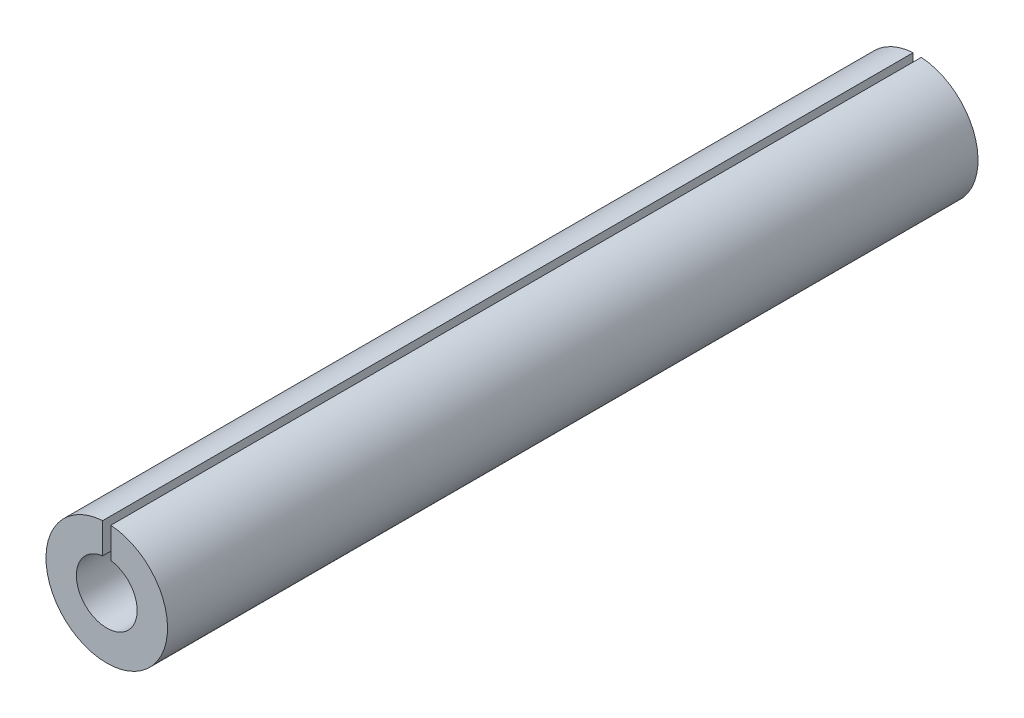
ISO-10303-21;
HEADER;
FILE_DESCRIPTION(('STEP AP214'),'2;1');
FILE_NAME('part.step','',(''),(''),'','','');
FILE_SCHEMA(('AUTOMOTIVE_DESIGN { 1 0 10303 214 1 1 1 1 }'));
ENDSEC;
DATA;
#1=APPLICATION_CONTEXT('core data for automotive mechanical design processes');
#2=APPLICATION_PROTOCOL_DEFINITION('international standard','automotive_design',2000,#1);
#3=PRODUCT_CONTEXT('',#1,'mechanical');
#4=PRODUCT('Part','Part','',(#3));
#5=PRODUCT_RELATED_PRODUCT_CATEGORY('part','',(#4));
#6=PRODUCT_DEFINITION_FORMATION('','',#4);
#7=PRODUCT_DEFINITION_CONTEXT('part definition',#1,'design');
#8=PRODUCT_DEFINITION('design','',#6,#7);
#9=PRODUCT_DEFINITION_SHAPE('','',#8);
#10=(LENGTH_UNIT() NAMED_UNIT(*) SI_UNIT(.MILLI.,.METRE.));
#11=(NAMED_UNIT(*) PLANE_ANGLE_UNIT() SI_UNIT($,.RADIAN.));
#12=(NAMED_UNIT(*) SI_UNIT($,.STERADIAN.) SOLID_ANGLE_UNIT());
#13=UNCERTAINTY_MEASURE_WITH_UNIT(LENGTH_MEASURE(1.E-05),#10,'distance_accuracy_value','');
#14=(GEOMETRIC_REPRESENTATION_CONTEXT(3) GLOBAL_UNCERTAINTY_ASSIGNED_CONTEXT((#13)) GLOBAL_UNIT_ASSIGNED_CONTEXT((#10,
#11,#12)) REPRESENTATION_CONTEXT('',''));
#15=CARTESIAN_POINT('',(0.,0.,0.));
#16=DIRECTION('',(0.,0.,1.));
#17=DIRECTION('',(1.,0.,0.));
#18=AXIS2_PLACEMENT_3D('',#15,#16,#17);
#19=CARTESIAN_POINT('',(0.,0.,20.));
#20=DIRECTION('',(0.,0.,1.));
#21=DIRECTION('',(1.,0.,0.));
#22=AXIS2_PLACEMENT_3D('',#19,#20,#21);
#23=PLANE('',#22);
#24=DIRECTION('',(0.,-1.,0.));
#25=VECTOR('',#24,1.);
#26=CARTESIAN_POINT('',(-0.099999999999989,1.58024481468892,20.));
#27=LINE('',#26,#25);
#28=CARTESIAN_POINT('',(-0.099999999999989,1.49666295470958,20.));
#29=VERTEX_POINT('',#28);
#30=CARTESIAN_POINT('',(-0.099999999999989,0.743303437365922,20.));
#31=VERTEX_POINT('',#30);
#32=EDGE_CURVE('E46',#29,#31,#27,.T.);
#33=ORIENTED_EDGE('',*,*,#32,.F.);
#34=CARTESIAN_POINT('',(0.,0.,20.));
#35=DIRECTION('',(0.,0.,1.));
#36=DIRECTION('',(1.,0.,0.));
#37=AXIS2_PLACEMENT_3D('',#34,#35,#36);
#38=CIRCLE('',#37,1.5);
#39=CARTESIAN_POINT('',(0.099999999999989,1.49666295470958,20.));
#40=VERTEX_POINT('',#39);
#41=EDGE_CURVE('E77',#29,#40,#38,.T.);
#42=ORIENTED_EDGE('',*,*,#41,.T.);
#43=DIRECTION('',(0.,1.,0.));
#44=VECTOR('',#43,1.);
#45=CARTESIAN_POINT('',(0.099999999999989,1.58024481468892,20.));
#46=LINE('',#45,#44);
#47=CARTESIAN_POINT('',(0.099999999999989,0.743303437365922,20.));
#48=VERTEX_POINT('',#47);
#49=EDGE_CURVE('E80',#48,#40,#46,.T.);
#50=ORIENTED_EDGE('',*,*,#49,.F.);
#51=CARTESIAN_POINT('',(0.,0.,20.));
#52=DIRECTION('',(0.,0.,1.));
#53=DIRECTION('',(1.,0.,0.));
#54=AXIS2_PLACEMENT_3D('',#51,#52,#53);
#55=CIRCLE('',#54,0.75);
#56=EDGE_CURVE('E79',#31,#48,#55,.T.);
#57=ORIENTED_EDGE('',*,*,#56,.F.);
#58=EDGE_LOOP('',(#33,#42,#50,#57));
#59=FACE_BOUND('',#58,.T.);
#60=ADVANCED_FACE('F24',(#59),#23,.T.);
#61=CARTESIAN_POINT('',(0.,0.,0.));
#62=DIRECTION('',(0.,0.,1.));
#63=DIRECTION('',(1.,0.,0.));
#64=AXIS2_PLACEMENT_3D('',#61,#62,#63);
#65=PLANE('',#64);
#66=CARTESIAN_POINT('',(0.,0.,0.));
#67=DIRECTION('',(0.,0.,1.));
#68=DIRECTION('',(1.,0.,0.));
#69=AXIS2_PLACEMENT_3D('',#66,#67,#68);
#70=CIRCLE('',#69,1.5);
#71=CARTESIAN_POINT('',(-0.099999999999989,1.49666295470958,0.));
#72=VERTEX_POINT('',#71);
#73=CARTESIAN_POINT('',(0.099999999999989,1.49666295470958,0.));
#74=VERTEX_POINT('',#73);
#75=EDGE_CURVE('E83',#72,#74,#70,.T.);
#76=ORIENTED_EDGE('',*,*,#75,.F.);
#77=DIRECTION('',(0.,-1.,0.));
#78=VECTOR('',#77,1.);
#79=CARTESIAN_POINT('',(-0.099999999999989,1.58024481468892,0.));
#80=LINE('',#79,#78);
#81=CARTESIAN_POINT('',(-0.099999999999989,0.743303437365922,0.));
#82=VERTEX_POINT('',#81);
#83=EDGE_CURVE('E65',#72,#82,#80,.T.);
#84=ORIENTED_EDGE('',*,*,#83,.T.);
#85=CARTESIAN_POINT('',(0.,0.,0.));
#86=DIRECTION('',(0.,0.,1.));
#87=DIRECTION('',(1.,0.,0.));
#88=AXIS2_PLACEMENT_3D('',#85,#86,#87);
#89=CIRCLE('',#88,0.75);
#90=CARTESIAN_POINT('',(0.099999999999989,0.743303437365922,0.));
#91=VERTEX_POINT('',#90);
#92=EDGE_CURVE('E70',#82,#91,#89,.T.);
#93=ORIENTED_EDGE('',*,*,#92,.T.);
#94=DIRECTION('',(0.,1.,0.));
#95=VECTOR('',#94,1.);
#96=CARTESIAN_POINT('',(0.099999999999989,1.58024481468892,0.));
#97=LINE('',#96,#95);
#98=EDGE_CURVE('E39',#91,#74,#97,.T.);
#99=ORIENTED_EDGE('',*,*,#98,.T.);
#100=EDGE_LOOP('',(#76,#84,#93,#99));
#101=FACE_BOUND('',#100,.T.);
#102=ADVANCED_FACE('F98',(#101),#65,.F.);
#103=CARTESIAN_POINT('',(0.,0.,20.));
#104=DIRECTION('',(0.,0.,-1.));
#105=DIRECTION('',(-1.,0.,0.));
#106=AXIS2_PLACEMENT_3D('',#103,#104,#105);
#107=CYLINDRICAL_SURFACE('',#106,1.5);
#108=ORIENTED_EDGE('',*,*,#41,.F.);
#109=DIRECTION('',(0.,0.,-1.));
#110=VECTOR('',#109,1.);
#111=CARTESIAN_POINT('',(-0.099999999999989,1.49666295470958,20.));
#112=LINE('',#111,#110);
#113=EDGE_CURVE('E62',#29,#72,#112,.T.);
#114=ORIENTED_EDGE('',*,*,#113,.T.);
#115=ORIENTED_EDGE('',*,*,#75,.T.);
#116=DIRECTION('',(0.,0.,-1.));
#117=VECTOR('',#116,1.);
#118=CARTESIAN_POINT('',(0.099999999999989,1.49666295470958,20.));
#119=LINE('',#118,#117);
#120=EDGE_CURVE('E71',#74,#40,#119,.F.);
#121=ORIENTED_EDGE('',*,*,#120,.T.);
#122=EDGE_LOOP('',(#108,#114,#115,#121));
#123=FACE_BOUND('',#122,.T.);
#124=ADVANCED_FACE('F26',(#123),#107,.T.);
#125=CARTESIAN_POINT('',(0.,0.,20.));
#126=DIRECTION('',(0.,0.,-1.));
#127=DIRECTION('',(-1.,0.,0.));
#128=AXIS2_PLACEMENT_3D('',#125,#126,#127);
#129=CYLINDRICAL_SURFACE('',#128,0.75);
#130=DIRECTION('',(0.,0.,-1.));
#131=VECTOR('',#130,1.);
#132=CARTESIAN_POINT('',(-0.099999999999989,0.743303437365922,20.));
#133=LINE('',#132,#131);
#134=EDGE_CURVE('E11',#31,#82,#133,.T.);
#135=ORIENTED_EDGE('',*,*,#134,.F.);
#136=ORIENTED_EDGE('',*,*,#56,.T.);
#137=DIRECTION('',(0.,0.,-1.));
#138=VECTOR('',#137,1.);
#139=CARTESIAN_POINT('',(0.099999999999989,0.743303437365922,20.));
#140=LINE('',#139,#138);
#141=EDGE_CURVE('E32',#91,#48,#140,.F.);
#142=ORIENTED_EDGE('',*,*,#141,.F.);
#143=ORIENTED_EDGE('',*,*,#92,.F.);
#144=EDGE_LOOP('',(#135,#136,#142,#143));
#145=FACE_BOUND('',#144,.T.);
#146=ADVANCED_FACE('F95',(#145),#129,.F.);
#147=CARTESIAN_POINT('',(0.099999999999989,1.58024481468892,0.));
#148=DIRECTION('',(1.,0.,0.));
#149=DIRECTION('',(0.,1.,0.));
#150=AXIS2_PLACEMENT_3D('',#147,#148,#149);
#151=PLANE('',#150);
#152=ORIENTED_EDGE('',*,*,#98,.F.);
#153=ORIENTED_EDGE('',*,*,#141,.T.);
#154=ORIENTED_EDGE('',*,*,#49,.T.);
#155=ORIENTED_EDGE('',*,*,#120,.F.);
#156=EDGE_LOOP('',(#152,#153,#154,#155));
#157=FACE_BOUND('',#156,.T.);
#158=ADVANCED_FACE('F93',(#157),#151,.F.);
#159=CARTESIAN_POINT('',(-0.099999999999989,1.58024481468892,0.));
#160=DIRECTION('',(-1.,0.,0.));
#161=DIRECTION('',(0.,-1.,0.));
#162=AXIS2_PLACEMENT_3D('',#159,#160,#161);
#163=PLANE('',#162);
#164=ORIENTED_EDGE('',*,*,#32,.T.);
#165=ORIENTED_EDGE('',*,*,#134,.T.);
#166=ORIENTED_EDGE('',*,*,#83,.F.);
#167=ORIENTED_EDGE('',*,*,#113,.F.);
#168=EDGE_LOOP('',(#164,#165,#166,#167));
#169=FACE_BOUND('',#168,.T.);
#170=ADVANCED_FACE('F63',(#169),#163,.F.);
#171=CLOSED_SHELL('',(#60,#102,#124,#146,#158,#170));
#172=MANIFOLD_SOLID_BREP('B2',#171);
#173=ADVANCED_BREP_SHAPE_REPRESENTATION('',(#18,#172),#14);
#174=SHAPE_DEFINITION_REPRESENTATION(#9,#173);
ENDSEC;
END-ISO-10303-21;
